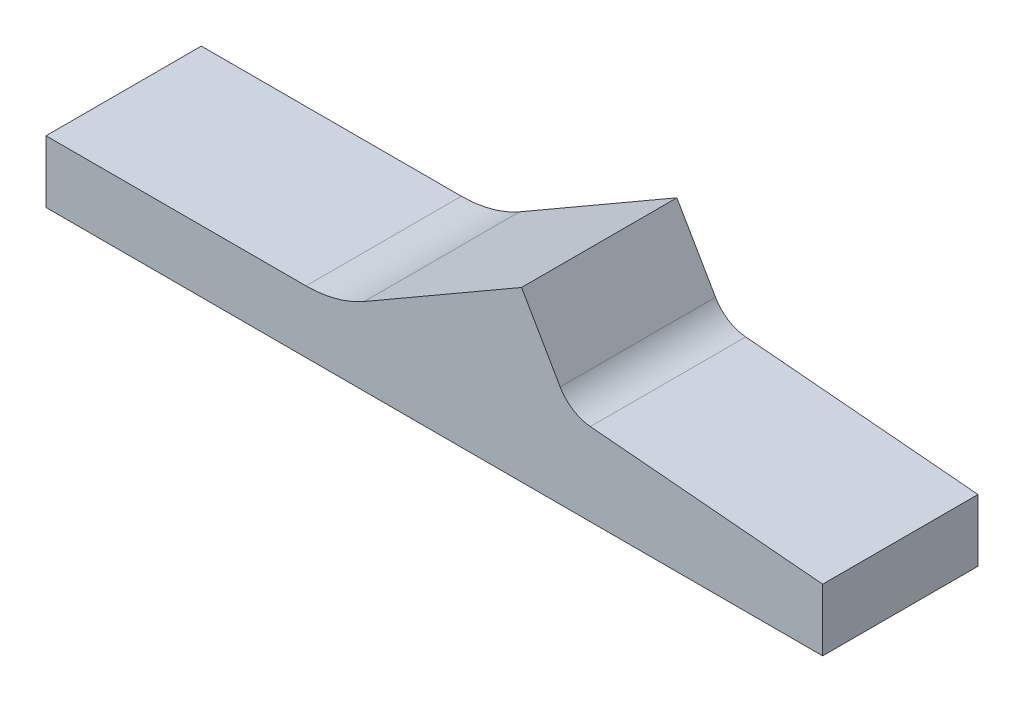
from build123d import *

# Parameters (mm, degrees)
BOSS_EXTRU_1_DEPTH = 20


with BuildPart() as part:
    # Esquisse1 → Boss.-Extru.1 (new, symmetric)
    with BuildSketch(Plane.XY):
        with BuildLine():
            Line((0, 0), (66.961524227, 0))
            ThreePointArc((66.961524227, 0), (74.72609558, 1.022225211), (81.961524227, 4.019237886))
            Line((81.961524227, 4.019237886), (122.462440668, 27.402452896))
            Line((122.462440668, 27.402452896), (132.397164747, 10.195006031))
            ThreePointArc((132.397164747, 10.195006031), (135.684422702, 6.761091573), (140.185861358, 5.23305905))
            Line((140.185861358, 5.23305905), (200, 0))
            Line((200, 0), (200, -16))
            Line((200, -16), (0, -16))
            Line((0, -16), (0, 0))
        make_face()
    extrude(amount=BOSS_EXTRU_1_DEPTH, both=True)


solid = part.part
